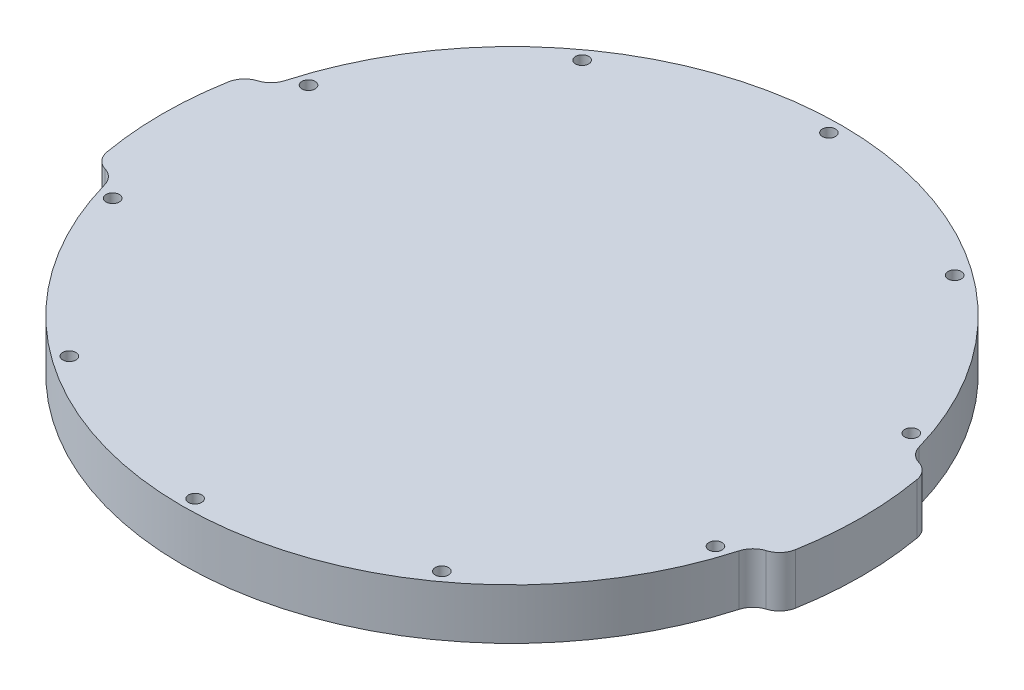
ISO-10303-21;
HEADER;
FILE_DESCRIPTION(('STEP AP214'),'2;1');
FILE_NAME('part.step','',(''),(''),'','','');
FILE_SCHEMA(('AUTOMOTIVE_DESIGN { 1 0 10303 214 1 1 1 1 }'));
ENDSEC;
DATA;
#1=APPLICATION_CONTEXT('core data for automotive mechanical design processes');
#2=APPLICATION_PROTOCOL_DEFINITION('international standard','automotive_design',2000,#1);
#3=PRODUCT_CONTEXT('',#1,'mechanical');
#4=PRODUCT('Part','Part','',(#3));
#5=PRODUCT_RELATED_PRODUCT_CATEGORY('part','',(#4));
#6=PRODUCT_DEFINITION_FORMATION('','',#4);
#7=PRODUCT_DEFINITION_CONTEXT('part definition',#1,'design');
#8=PRODUCT_DEFINITION('design','',#6,#7);
#9=PRODUCT_DEFINITION_SHAPE('','',#8);
#10=(LENGTH_UNIT() NAMED_UNIT(*) SI_UNIT(.MILLI.,.METRE.));
#11=(NAMED_UNIT(*) PLANE_ANGLE_UNIT() SI_UNIT($,.RADIAN.));
#12=(NAMED_UNIT(*) SI_UNIT($,.STERADIAN.) SOLID_ANGLE_UNIT());
#13=UNCERTAINTY_MEASURE_WITH_UNIT(LENGTH_MEASURE(1.E-05),#10,'distance_accuracy_value','');
#14=(GEOMETRIC_REPRESENTATION_CONTEXT(3) GLOBAL_UNCERTAINTY_ASSIGNED_CONTEXT((#13)) GLOBAL_UNIT_ASSIGNED_CONTEXT((#10,
#11,#12)) REPRESENTATION_CONTEXT('',''));
#15=CARTESIAN_POINT('',(0.,0.,0.));
#16=DIRECTION('',(0.,0.,1.));
#17=DIRECTION('',(1.,0.,0.));
#18=AXIS2_PLACEMENT_3D('',#15,#16,#17);
#19=CARTESIAN_POINT('',(-40.6479400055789,12.7,-7.16732853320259));
#20=DIRECTION('',(0.,-1.,0.));
#21=DIRECTION('',(0.,0.,-1.));
#22=AXIS2_PLACEMENT_3D('',#19,#20,#21);
#23=PLANE('',#22);
#24=CARTESIAN_POINT('',(-75.4663345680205,12.7,-24.5204985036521));
#25=DIRECTION('',(0.,1.,0.));
#26=DIRECTION('',(0.,0.,1.));
#27=AXIS2_PLACEMENT_3D('',#24,#25,#26);
#28=CIRCLE('',#27,1.6500000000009);
#29=CARTESIAN_POINT('',(-75.4663345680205,12.7,-22.8704985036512));
#30=VERTEX_POINT('',#29);
#31=EDGE_CURVE('E344',#30,#30,#28,.T.);
#32=ORIENTED_EDGE('',*,*,#31,.F.);
#33=EDGE_LOOP('',(#32));
#34=FACE_BOUND('',#33,.T.);
#35=CARTESIAN_POINT('',(-46.6407597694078,12.7,64.1954985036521));
#36=DIRECTION('',(0.,1.,0.));
#37=DIRECTION('',(0.,0.,1.));
#38=AXIS2_PLACEMENT_3D('',#35,#36,#37);
#39=CIRCLE('',#38,1.65000000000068);
#40=CARTESIAN_POINT('',(-46.6407597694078,12.7,65.8454985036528));
#41=VERTEX_POINT('',#40);
#42=EDGE_CURVE('E332',#41,#41,#39,.T.);
#43=ORIENTED_EDGE('',*,*,#42,.F.);
#44=EDGE_LOOP('',(#43));
#45=FACE_BOUND('',#44,.T.);
#46=CARTESIAN_POINT('',(46.6407597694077,12.7,64.1954985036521));
#47=DIRECTION('',(0.,1.,0.));
#48=DIRECTION('',(0.,0.,1.));
#49=AXIS2_PLACEMENT_3D('',#46,#47,#48);
#50=CIRCLE('',#49,1.65000000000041);
#51=CARTESIAN_POINT('',(46.6407597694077,12.7,65.8454985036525));
#52=VERTEX_POINT('',#51);
#53=EDGE_CURVE('E320',#52,#52,#50,.T.);
#54=ORIENTED_EDGE('',*,*,#53,.F.);
#55=EDGE_LOOP('',(#54));
#56=FACE_BOUND('',#55,.T.);
#57=CARTESIAN_POINT('',(75.4663345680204,12.7,-24.5204985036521));
#58=DIRECTION('',(0.,1.,0.));
#59=DIRECTION('',(0.,0.,1.));
#60=AXIS2_PLACEMENT_3D('',#57,#58,#59);
#61=CIRCLE('',#60,1.65000000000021);
#62=CARTESIAN_POINT('',(75.4663345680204,12.7,-22.8704985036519));
#63=VERTEX_POINT('',#62);
#64=EDGE_CURVE('E308',#63,#63,#61,.T.);
#65=ORIENTED_EDGE('',*,*,#64,.F.);
#66=EDGE_LOOP('',(#65));
#67=FACE_BOUND('',#66,.T.);
#68=CARTESIAN_POINT('',(0.,12.7,-79.35));
#69=DIRECTION('',(0.,1.,0.));
#70=DIRECTION('',(0.,0.,1.));
#71=AXIS2_PLACEMENT_3D('',#68,#69,#70);
#72=CIRCLE('',#71,1.65);
#73=CARTESIAN_POINT('',(0.,12.7,-77.7));
#74=VERTEX_POINT('',#73);
#75=EDGE_CURVE('E276',#74,#74,#72,.T.);
#76=ORIENTED_EDGE('',*,*,#75,.F.);
#77=EDGE_LOOP('',(#76));
#78=FACE_BOUND('',#77,.T.);
#79=CARTESIAN_POINT('',(0.,12.7,0.));
#80=DIRECTION('',(0.,1.,0.));
#81=DIRECTION('',(0.,0.,-1.));
#82=AXIS2_PLACEMENT_3D('',#79,#80,#81);
#83=CIRCLE('',#82,82.55);
#84=CARTESIAN_POINT('',(79.4156922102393,12.7,-22.5310969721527));
#85=VERTEX_POINT('',#84);
#86=CARTESIAN_POINT('',(-79.4156922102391,12.7,-22.531096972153));
#87=VERTEX_POINT('',#86);
#88=EDGE_CURVE('E271',#85,#87,#83,.T.);
#89=ORIENTED_EDGE('',*,*,#88,.T.);
#90=CARTESIAN_POINT('',(-84.2258492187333,12.7,-23.8957909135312));
#91=DIRECTION('',(0.,-1.,0.));
#92=DIRECTION('',(0.,0.,-1.));
#93=AXIS2_PLACEMENT_3D('',#90,#91,#92);
#94=CIRCLE('',#93,5.);
#95=CARTESIAN_POINT('',(-82.7608646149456,12.7,-19.1152239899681));
#96=VERTEX_POINT('',#95);
#97=EDGE_CURVE('E127',#87,#96,#94,.T.);
#98=ORIENTED_EDGE('',*,*,#97,.T.);
#99=CARTESIAN_POINT('',(-81.2958800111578,12.7,-14.3346570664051));
#100=DIRECTION('',(0.,1.,0.));
#101=DIRECTION('',(0.,0.,-1.));
#102=AXIS2_PLACEMENT_3D('',#99,#100,#101);
#103=CIRCLE('',#102,5.00000000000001);
#104=CARTESIAN_POINT('',(-86.2199187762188,12.7,-15.2028979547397));
#105=VERTEX_POINT('',#104);
#106=EDGE_CURVE('E120',#96,#105,#103,.T.);
#107=ORIENTED_EDGE('',*,*,#106,.T.);
#108=CARTESIAN_POINT('',(0.,12.7,0.));
#109=DIRECTION('',(0.,1.,0.));
#110=DIRECTION('',(0.,0.,-1.));
#111=AXIS2_PLACEMENT_3D('',#108,#109,#110);
#112=CIRCLE('',#111,87.55);
#113=CARTESIAN_POINT('',(-86.2199187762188,12.7,15.2028979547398));
#114=VERTEX_POINT('',#113);
#115=EDGE_CURVE('E124',#105,#114,#112,.T.);
#116=ORIENTED_EDGE('',*,*,#115,.T.);
#117=CARTESIAN_POINT('',(-81.2958800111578,12.7,14.3346570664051));
#118=DIRECTION('',(0.,1.,0.));
#119=DIRECTION('',(0.,0.,1.));
#120=AXIS2_PLACEMENT_3D('',#117,#118,#119);
#121=CIRCLE('',#120,5.00000000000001);
#122=CARTESIAN_POINT('',(-82.7608646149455,12.7,19.1152239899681));
#123=VERTEX_POINT('',#122);
#124=EDGE_CURVE('E140',#114,#123,#121,.T.);
#125=ORIENTED_EDGE('',*,*,#124,.T.);
#126=CARTESIAN_POINT('',(-84.2258492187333,12.7,23.8957909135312));
#127=DIRECTION('',(0.,-1.,0.));
#128=DIRECTION('',(0.,0.,-1.));
#129=AXIS2_PLACEMENT_3D('',#126,#127,#128);
#130=CIRCLE('',#129,5.);
#131=CARTESIAN_POINT('',(-79.4156922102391,12.7,22.531096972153));
#132=VERTEX_POINT('',#131);
#133=EDGE_CURVE('E11',#123,#132,#130,.T.);
#134=ORIENTED_EDGE('',*,*,#133,.T.);
#135=CARTESIAN_POINT('',(0.,12.7,-4.92661467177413E-13));
#136=DIRECTION('',(0.,1.,0.));
#137=DIRECTION('',(0.,0.,-1.));
#138=AXIS2_PLACEMENT_3D('',#135,#136,#137);
#139=CIRCLE('',#138,82.5500000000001);
#140=CARTESIAN_POINT('',(79.4156922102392,12.7,22.5310969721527));
#141=VERTEX_POINT('',#140);
#142=EDGE_CURVE('E258',#132,#141,#139,.T.);
#143=ORIENTED_EDGE('',*,*,#142,.T.);
#144=CARTESIAN_POINT('',(84.2258492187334,12.7,23.8957909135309));
#145=DIRECTION('',(0.,-1.,0.));
#146=DIRECTION('',(0.,0.,-1.));
#147=AXIS2_PLACEMENT_3D('',#144,#145,#146);
#148=CIRCLE('',#147,5.);
#149=CARTESIAN_POINT('',(82.7608646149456,12.7,19.1152239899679));
#150=VERTEX_POINT('',#149);
#151=EDGE_CURVE('E171',#141,#150,#148,.T.);
#152=ORIENTED_EDGE('',*,*,#151,.T.);
#153=CARTESIAN_POINT('',(81.2958800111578,12.7,14.3346570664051));
#154=DIRECTION('',(0.,1.,0.));
#155=DIRECTION('',(0.,0.,-1.));
#156=AXIS2_PLACEMENT_3D('',#153,#154,#155);
#157=CIRCLE('',#156,4.99999999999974);
#158=CARTESIAN_POINT('',(86.2199187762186,12.7,15.2028979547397));
#159=VERTEX_POINT('',#158);
#160=EDGE_CURVE('E255',#150,#159,#157,.T.);
#161=ORIENTED_EDGE('',*,*,#160,.T.);
#162=CARTESIAN_POINT('',(-1.29063426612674E-12,12.7,0.));
#163=DIRECTION('',(0.,1.,0.));
#164=DIRECTION('',(0.,0.,1.));
#165=AXIS2_PLACEMENT_3D('',#162,#163,#164);
#166=CIRCLE('',#165,87.550000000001);
#167=CARTESIAN_POINT('',(86.2199187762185,12.7,-15.2028979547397));
#168=VERTEX_POINT('',#167);
#169=EDGE_CURVE('E262',#159,#168,#166,.T.);
#170=ORIENTED_EDGE('',*,*,#169,.T.);
#171=CARTESIAN_POINT('',(81.2958800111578,12.7,-14.3346570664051));
#172=DIRECTION('',(0.,1.,0.));
#173=DIRECTION('',(0.,0.,1.));
#174=AXIS2_PLACEMENT_3D('',#171,#172,#173);
#175=CIRCLE('',#174,4.99999999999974);
#176=CARTESIAN_POINT('',(82.7608646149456,12.7,-19.1152239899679));
#177=VERTEX_POINT('',#176);
#178=EDGE_CURVE('E264',#168,#177,#175,.T.);
#179=ORIENTED_EDGE('',*,*,#178,.T.);
#180=CARTESIAN_POINT('',(84.2258492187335,12.7,-23.8957909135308));
#181=DIRECTION('',(0.,-1.,0.));
#182=DIRECTION('',(0.,0.,-1.));
#183=AXIS2_PLACEMENT_3D('',#180,#181,#182);
#184=CIRCLE('',#183,5.);
#185=EDGE_CURVE('E175',#177,#85,#184,.T.);
#186=ORIENTED_EDGE('',*,*,#185,.T.);
#187=EDGE_LOOP('',(#89,#98,#107,#116,#125,#134,#143,#152,#161,#170,#179,#186));
#188=FACE_BOUND('',#187,.T.);
#189=CARTESIAN_POINT('',(46.6407597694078,12.7,-64.1954985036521));
#190=DIRECTION('',(0.,1.,0.));
#191=DIRECTION('',(0.,0.,1.));
#192=AXIS2_PLACEMENT_3D('',#189,#190,#191);
#193=CIRCLE('',#192,1.65000000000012);
#194=CARTESIAN_POINT('',(46.6407597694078,12.7,-62.5454985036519));
#195=VERTEX_POINT('',#194);
#196=EDGE_CURVE('E302',#195,#195,#193,.T.);
#197=ORIENTED_EDGE('',*,*,#196,.F.);
#198=EDGE_LOOP('',(#197));
#199=FACE_BOUND('',#198,.T.);
#200=CARTESIAN_POINT('',(75.4663345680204,12.7,24.5204985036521));
#201=DIRECTION('',(0.,1.,0.));
#202=DIRECTION('',(0.,0.,1.));
#203=AXIS2_PLACEMENT_3D('',#200,#201,#202);
#204=CIRCLE('',#203,1.65000000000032);
#205=CARTESIAN_POINT('',(75.4663345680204,12.7,26.1704985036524));
#206=VERTEX_POINT('',#205);
#207=EDGE_CURVE('E314',#206,#206,#204,.T.);
#208=ORIENTED_EDGE('',*,*,#207,.F.);
#209=EDGE_LOOP('',(#208));
#210=FACE_BOUND('',#209,.T.);
#211=CARTESIAN_POINT('',(0.,12.7,79.35));
#212=DIRECTION('',(0.,1.,0.));
#213=DIRECTION('',(0.,0.,1.));
#214=AXIS2_PLACEMENT_3D('',#211,#212,#213);
#215=CIRCLE('',#214,1.65000000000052);
#216=CARTESIAN_POINT('',(0.,12.7,81.0000000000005));
#217=VERTEX_POINT('',#216);
#218=EDGE_CURVE('E326',#217,#217,#215,.T.);
#219=ORIENTED_EDGE('',*,*,#218,.F.);
#220=EDGE_LOOP('',(#219));
#221=FACE_BOUND('',#220,.T.);
#222=CARTESIAN_POINT('',(-75.4663345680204,12.7,24.5204985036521));
#223=DIRECTION('',(0.,1.,0.));
#224=DIRECTION('',(0.,0.,1.));
#225=AXIS2_PLACEMENT_3D('',#222,#223,#224);
#226=CIRCLE('',#225,1.65000000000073);
#227=CARTESIAN_POINT('',(-75.4663345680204,12.7,26.1704985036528));
#228=VERTEX_POINT('',#227);
#229=EDGE_CURVE('E338',#228,#228,#226,.T.);
#230=ORIENTED_EDGE('',*,*,#229,.F.);
#231=EDGE_LOOP('',(#230));
#232=FACE_BOUND('',#231,.T.);
#233=CARTESIAN_POINT('',(-46.6407597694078,12.7,-64.1954985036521));
#234=DIRECTION('',(0.,1.,0.));
#235=DIRECTION('',(0.,0.,1.));
#236=AXIS2_PLACEMENT_3D('',#233,#234,#235);
#237=CIRCLE('',#236,1.65000000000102);
#238=CARTESIAN_POINT('',(-46.6407597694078,12.7,-62.545498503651));
#239=VERTEX_POINT('',#238);
#240=EDGE_CURVE('E350',#239,#239,#237,.T.);
#241=ORIENTED_EDGE('',*,*,#240,.F.);
#242=EDGE_LOOP('',(#241));
#243=FACE_BOUND('',#242,.T.);
#244=ADVANCED_FACE('F32',(#34,#45,#56,#67,#78,#188,#199,#210,#221,#232,#243),#23,.F.);
#245=CARTESIAN_POINT('',(-40.6479400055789,0.,-7.16732853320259));
#246=DIRECTION('',(0.,-1.,0.));
#247=DIRECTION('',(0.,0.,-1.));
#248=AXIS2_PLACEMENT_3D('',#245,#246,#247);
#249=PLANE('',#248);
#250=CARTESIAN_POINT('',(-75.4663345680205,0.,-24.5204985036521));
#251=DIRECTION('',(0.,1.,0.));
#252=DIRECTION('',(0.,0.,1.));
#253=AXIS2_PLACEMENT_3D('',#250,#251,#252);
#254=CIRCLE('',#253,1.6500000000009);
#255=CARTESIAN_POINT('',(-75.4663345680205,0.,-22.8704985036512));
#256=VERTEX_POINT('',#255);
#257=EDGE_CURVE('E347',#256,#256,#254,.T.);
#258=ORIENTED_EDGE('',*,*,#257,.T.);
#259=EDGE_LOOP('',(#258));
#260=FACE_BOUND('',#259,.T.);
#261=CARTESIAN_POINT('',(-46.6407597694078,0.,64.1954985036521));
#262=DIRECTION('',(0.,1.,0.));
#263=DIRECTION('',(0.,0.,1.));
#264=AXIS2_PLACEMENT_3D('',#261,#262,#263);
#265=CIRCLE('',#264,1.65000000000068);
#266=CARTESIAN_POINT('',(-46.6407597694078,0.,65.8454985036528));
#267=VERTEX_POINT('',#266);
#268=EDGE_CURVE('E335',#267,#267,#265,.T.);
#269=ORIENTED_EDGE('',*,*,#268,.T.);
#270=EDGE_LOOP('',(#269));
#271=FACE_BOUND('',#270,.T.);
#272=CARTESIAN_POINT('',(46.6407597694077,0.,64.1954985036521));
#273=DIRECTION('',(0.,1.,0.));
#274=DIRECTION('',(0.,0.,1.));
#275=AXIS2_PLACEMENT_3D('',#272,#273,#274);
#276=CIRCLE('',#275,1.65000000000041);
#277=CARTESIAN_POINT('',(46.6407597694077,0.,65.8454985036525));
#278=VERTEX_POINT('',#277);
#279=EDGE_CURVE('E323',#278,#278,#276,.T.);
#280=ORIENTED_EDGE('',*,*,#279,.T.);
#281=EDGE_LOOP('',(#280));
#282=FACE_BOUND('',#281,.T.);
#283=CARTESIAN_POINT('',(75.4663345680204,0.,-24.5204985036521));
#284=DIRECTION('',(0.,1.,0.));
#285=DIRECTION('',(0.,0.,1.));
#286=AXIS2_PLACEMENT_3D('',#283,#284,#285);
#287=CIRCLE('',#286,1.65000000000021);
#288=CARTESIAN_POINT('',(75.4663345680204,0.,-22.8704985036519));
#289=VERTEX_POINT('',#288);
#290=EDGE_CURVE('E311',#289,#289,#287,.T.);
#291=ORIENTED_EDGE('',*,*,#290,.T.);
#292=EDGE_LOOP('',(#291));
#293=FACE_BOUND('',#292,.T.);
#294=CARTESIAN_POINT('',(0.,0.,-79.35));
#295=DIRECTION('',(0.,1.,0.));
#296=DIRECTION('',(0.,0.,1.));
#297=AXIS2_PLACEMENT_3D('',#294,#295,#296);
#298=CIRCLE('',#297,1.65);
#299=CARTESIAN_POINT('',(0.,0.,-77.7));
#300=VERTEX_POINT('',#299);
#301=EDGE_CURVE('E299',#300,#300,#298,.T.);
#302=ORIENTED_EDGE('',*,*,#301,.T.);
#303=EDGE_LOOP('',(#302));
#304=FACE_BOUND('',#303,.T.);
#305=CARTESIAN_POINT('',(-81.2958800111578,0.,-14.3346570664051));
#306=DIRECTION('',(0.,1.,0.));
#307=DIRECTION('',(0.,0.,-1.));
#308=AXIS2_PLACEMENT_3D('',#305,#306,#307);
#309=CIRCLE('',#308,5.00000000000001);
#310=CARTESIAN_POINT('',(-82.7608646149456,0.,-19.1152239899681));
#311=VERTEX_POINT('',#310);
#312=CARTESIAN_POINT('',(-86.2199187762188,0.,-15.2028979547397));
#313=VERTEX_POINT('',#312);
#314=EDGE_CURVE('E144',#311,#313,#309,.T.);
#315=ORIENTED_EDGE('',*,*,#314,.F.);
#316=CARTESIAN_POINT('',(-84.2258492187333,0.,-23.8957909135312));
#317=DIRECTION('',(0.,-1.,0.));
#318=DIRECTION('',(0.,0.,-1.));
#319=AXIS2_PLACEMENT_3D('',#316,#317,#318);
#320=CIRCLE('',#319,5.);
#321=CARTESIAN_POINT('',(-79.4156922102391,0.,-22.531096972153));
#322=VERTEX_POINT('',#321);
#323=EDGE_CURVE('E177',#311,#322,#320,.F.);
#324=ORIENTED_EDGE('',*,*,#323,.T.);
#325=CARTESIAN_POINT('',(0.,0.,0.));
#326=DIRECTION('',(0.,1.,0.));
#327=DIRECTION('',(0.,0.,-1.));
#328=AXIS2_PLACEMENT_3D('',#325,#326,#327);
#329=CIRCLE('',#328,82.55);
#330=CARTESIAN_POINT('',(79.4156922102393,0.,-22.5310969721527));
#331=VERTEX_POINT('',#330);
#332=EDGE_CURVE('E132',#331,#322,#329,.T.);
#333=ORIENTED_EDGE('',*,*,#332,.F.);
#334=CARTESIAN_POINT('',(84.2258492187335,0.,-23.8957909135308));
#335=DIRECTION('',(0.,-1.,0.));
#336=DIRECTION('',(0.,0.,-1.));
#337=AXIS2_PLACEMENT_3D('',#334,#335,#336);
#338=CIRCLE('',#337,5.);
#339=CARTESIAN_POINT('',(82.7608646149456,0.,-19.1152239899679));
#340=VERTEX_POINT('',#339);
#341=EDGE_CURVE('E173',#331,#340,#338,.F.);
#342=ORIENTED_EDGE('',*,*,#341,.T.);
#343=CARTESIAN_POINT('',(81.2958800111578,0.,-14.3346570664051));
#344=DIRECTION('',(0.,1.,0.));
#345=DIRECTION('',(0.,0.,1.));
#346=AXIS2_PLACEMENT_3D('',#343,#344,#345);
#347=CIRCLE('',#346,4.99999999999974);
#348=CARTESIAN_POINT('',(86.2199187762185,0.,-15.2028979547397));
#349=VERTEX_POINT('',#348);
#350=EDGE_CURVE('E189',#349,#340,#347,.T.);
#351=ORIENTED_EDGE('',*,*,#350,.F.);
#352=CARTESIAN_POINT('',(-1.29063426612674E-12,0.,0.));
#353=DIRECTION('',(0.,1.,0.));
#354=DIRECTION('',(0.,0.,1.));
#355=AXIS2_PLACEMENT_3D('',#352,#353,#354);
#356=CIRCLE('',#355,87.550000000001);
#357=CARTESIAN_POINT('',(86.2199187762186,0.,15.2028979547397));
#358=VERTEX_POINT('',#357);
#359=EDGE_CURVE('E285',#358,#349,#356,.T.);
#360=ORIENTED_EDGE('',*,*,#359,.F.);
#361=CARTESIAN_POINT('',(81.2958800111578,0.,14.3346570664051));
#362=DIRECTION('',(0.,1.,0.));
#363=DIRECTION('',(0.,0.,-1.));
#364=AXIS2_PLACEMENT_3D('',#361,#362,#363);
#365=CIRCLE('',#364,4.99999999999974);
#366=CARTESIAN_POINT('',(82.7608646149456,0.,19.1152239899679));
#367=VERTEX_POINT('',#366);
#368=EDGE_CURVE('E283',#367,#358,#365,.T.);
#369=ORIENTED_EDGE('',*,*,#368,.F.);
#370=CARTESIAN_POINT('',(84.2258492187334,0.,23.8957909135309));
#371=DIRECTION('',(0.,-1.,0.));
#372=DIRECTION('',(0.,0.,-1.));
#373=AXIS2_PLACEMENT_3D('',#370,#371,#372);
#374=CIRCLE('',#373,5.);
#375=CARTESIAN_POINT('',(79.4156922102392,0.,22.5310969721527));
#376=VERTEX_POINT('',#375);
#377=EDGE_CURVE('E169',#367,#376,#374,.F.);
#378=ORIENTED_EDGE('',*,*,#377,.T.);
#379=CARTESIAN_POINT('',(0.,0.,-4.92661467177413E-13));
#380=DIRECTION('',(0.,1.,0.));
#381=DIRECTION('',(0.,0.,-1.));
#382=AXIS2_PLACEMENT_3D('',#379,#380,#381);
#383=CIRCLE('',#382,82.5500000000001);
#384=CARTESIAN_POINT('',(-79.4156922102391,0.,22.531096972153));
#385=VERTEX_POINT('',#384);
#386=EDGE_CURVE('E280',#385,#376,#383,.T.);
#387=ORIENTED_EDGE('',*,*,#386,.F.);
#388=CARTESIAN_POINT('',(-84.2258492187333,0.,23.8957909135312));
#389=DIRECTION('',(0.,-1.,0.));
#390=DIRECTION('',(0.,0.,-1.));
#391=AXIS2_PLACEMENT_3D('',#388,#389,#390);
#392=CIRCLE('',#391,5.);
#393=CARTESIAN_POINT('',(-82.7608646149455,0.,19.1152239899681));
#394=VERTEX_POINT('',#393);
#395=EDGE_CURVE('E40',#385,#394,#392,.F.);
#396=ORIENTED_EDGE('',*,*,#395,.T.);
#397=CARTESIAN_POINT('',(-81.2958800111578,0.,14.3346570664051));
#398=DIRECTION('',(0.,1.,0.));
#399=DIRECTION('',(0.,0.,1.));
#400=AXIS2_PLACEMENT_3D('',#397,#398,#399);
#401=CIRCLE('',#400,5.00000000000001);
#402=CARTESIAN_POINT('',(-86.2199187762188,0.,15.2028979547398));
#403=VERTEX_POINT('',#402);
#404=EDGE_CURVE('E278',#403,#394,#401,.T.);
#405=ORIENTED_EDGE('',*,*,#404,.F.);
#406=CARTESIAN_POINT('',(0.,0.,0.));
#407=DIRECTION('',(0.,1.,0.));
#408=DIRECTION('',(0.,0.,-1.));
#409=AXIS2_PLACEMENT_3D('',#406,#407,#408);
#410=CIRCLE('',#409,87.55);
#411=EDGE_CURVE('E275',#313,#403,#410,.T.);
#412=ORIENTED_EDGE('',*,*,#411,.F.);
#413=EDGE_LOOP('',(#315,#324,#333,#342,#351,#360,#369,#378,#387,#396,#405,#412));
#414=FACE_BOUND('',#413,.T.);
#415=CARTESIAN_POINT('',(46.6407597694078,0.,-64.1954985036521));
#416=DIRECTION('',(0.,1.,0.));
#417=DIRECTION('',(0.,0.,1.));
#418=AXIS2_PLACEMENT_3D('',#415,#416,#417);
#419=CIRCLE('',#418,1.65000000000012);
#420=CARTESIAN_POINT('',(46.6407597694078,0.,-62.5454985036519));
#421=VERTEX_POINT('',#420);
#422=EDGE_CURVE('E305',#421,#421,#419,.T.);
#423=ORIENTED_EDGE('',*,*,#422,.T.);
#424=EDGE_LOOP('',(#423));
#425=FACE_BOUND('',#424,.T.);
#426=CARTESIAN_POINT('',(75.4663345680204,0.,24.5204985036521));
#427=DIRECTION('',(0.,1.,0.));
#428=DIRECTION('',(0.,0.,1.));
#429=AXIS2_PLACEMENT_3D('',#426,#427,#428);
#430=CIRCLE('',#429,1.65000000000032);
#431=CARTESIAN_POINT('',(75.4663345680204,0.,26.1704985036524));
#432=VERTEX_POINT('',#431);
#433=EDGE_CURVE('E317',#432,#432,#430,.T.);
#434=ORIENTED_EDGE('',*,*,#433,.T.);
#435=EDGE_LOOP('',(#434));
#436=FACE_BOUND('',#435,.T.);
#437=CARTESIAN_POINT('',(0.,0.,79.35));
#438=DIRECTION('',(0.,1.,0.));
#439=DIRECTION('',(0.,0.,1.));
#440=AXIS2_PLACEMENT_3D('',#437,#438,#439);
#441=CIRCLE('',#440,1.65000000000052);
#442=CARTESIAN_POINT('',(0.,0.,81.0000000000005));
#443=VERTEX_POINT('',#442);
#444=EDGE_CURVE('E329',#443,#443,#441,.T.);
#445=ORIENTED_EDGE('',*,*,#444,.T.);
#446=EDGE_LOOP('',(#445));
#447=FACE_BOUND('',#446,.T.);
#448=CARTESIAN_POINT('',(-75.4663345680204,0.,24.5204985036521));
#449=DIRECTION('',(0.,1.,0.));
#450=DIRECTION('',(0.,0.,1.));
#451=AXIS2_PLACEMENT_3D('',#448,#449,#450);
#452=CIRCLE('',#451,1.65000000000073);
#453=CARTESIAN_POINT('',(-75.4663345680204,0.,26.1704985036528));
#454=VERTEX_POINT('',#453);
#455=EDGE_CURVE('E341',#454,#454,#452,.T.);
#456=ORIENTED_EDGE('',*,*,#455,.T.);
#457=EDGE_LOOP('',(#456));
#458=FACE_BOUND('',#457,.T.);
#459=CARTESIAN_POINT('',(-46.6407597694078,0.,-64.1954985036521));
#460=DIRECTION('',(0.,1.,0.));
#461=DIRECTION('',(0.,0.,1.));
#462=AXIS2_PLACEMENT_3D('',#459,#460,#461);
#463=CIRCLE('',#462,1.65000000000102);
#464=CARTESIAN_POINT('',(-46.6407597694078,0.,-62.545498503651));
#465=VERTEX_POINT('',#464);
#466=EDGE_CURVE('E353',#465,#465,#463,.T.);
#467=ORIENTED_EDGE('',*,*,#466,.T.);
#468=EDGE_LOOP('',(#467));
#469=FACE_BOUND('',#468,.T.);
#470=ADVANCED_FACE('F181',(#260,#271,#282,#293,#304,#414,#425,#436,#447,#458,#469),#249,.T.);
#471=CARTESIAN_POINT('',(-81.2958800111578,12.7,-14.3346570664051));
#472=DIRECTION('',(0.,-1.,0.));
#473=DIRECTION('',(0.,0.,-1.));
#474=AXIS2_PLACEMENT_3D('',#471,#472,#473);
#475=CYLINDRICAL_SURFACE('',#474,5.00000000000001);
#476=ORIENTED_EDGE('',*,*,#106,.F.);
#477=DIRECTION('',(0.,-1.,0.));
#478=VECTOR('',#477,1.);
#479=CARTESIAN_POINT('',(-82.7608646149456,12.7,-19.1152239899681));
#480=LINE('',#479,#478);
#481=EDGE_CURVE('E166',#96,#311,#480,.T.);
#482=ORIENTED_EDGE('',*,*,#481,.T.);
#483=ORIENTED_EDGE('',*,*,#314,.T.);
#484=DIRECTION('',(0.,-1.,0.));
#485=VECTOR('',#484,1.);
#486=CARTESIAN_POINT('',(-86.2199187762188,12.7,-15.2028979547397));
#487=LINE('',#486,#485);
#488=EDGE_CURVE('E137',#105,#313,#487,.T.);
#489=ORIENTED_EDGE('',*,*,#488,.F.);
#490=EDGE_LOOP('',(#476,#482,#483,#489));
#491=FACE_BOUND('',#490,.T.);
#492=ADVANCED_FACE('F142',(#491),#475,.T.);
#493=CARTESIAN_POINT('',(0.,12.7,0.));
#494=DIRECTION('',(0.,-1.,0.));
#495=DIRECTION('',(0.,0.,-1.));
#496=AXIS2_PLACEMENT_3D('',#493,#494,#495);
#497=CYLINDRICAL_SURFACE('',#496,87.55);
#498=ORIENTED_EDGE('',*,*,#411,.T.);
#499=DIRECTION('',(0.,-1.,0.));
#500=VECTOR('',#499,1.);
#501=CARTESIAN_POINT('',(-86.2199187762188,12.7,15.2028979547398));
#502=LINE('',#501,#500);
#503=EDGE_CURVE('E139',#114,#403,#502,.T.);
#504=ORIENTED_EDGE('',*,*,#503,.F.);
#505=ORIENTED_EDGE('',*,*,#115,.F.);
#506=ORIENTED_EDGE('',*,*,#488,.T.);
#507=EDGE_LOOP('',(#498,#504,#505,#506));
#508=FACE_BOUND('',#507,.T.);
#509=ADVANCED_FACE('F136',(#508),#497,.T.);
#510=CARTESIAN_POINT('',(-81.2958800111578,12.7,14.3346570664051));
#511=DIRECTION('',(0.,-1.,0.));
#512=DIRECTION('',(0.,0.,-1.));
#513=AXIS2_PLACEMENT_3D('',#510,#511,#512);
#514=CYLINDRICAL_SURFACE('',#513,5.00000000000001);
#515=ORIENTED_EDGE('',*,*,#404,.T.);
#516=DIRECTION('',(0.,-1.,0.));
#517=VECTOR('',#516,1.);
#518=CARTESIAN_POINT('',(-82.7608646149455,12.7,19.1152239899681));
#519=LINE('',#518,#517);
#520=EDGE_CURVE('E47',#394,#123,#519,.F.);
#521=ORIENTED_EDGE('',*,*,#520,.T.);
#522=ORIENTED_EDGE('',*,*,#124,.F.);
#523=ORIENTED_EDGE('',*,*,#503,.T.);
#524=EDGE_LOOP('',(#515,#521,#522,#523));
#525=FACE_BOUND('',#524,.T.);
#526=ADVANCED_FACE('F233',(#525),#514,.T.);
#527=CARTESIAN_POINT('',(0.,12.7,-4.92661467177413E-13));
#528=DIRECTION('',(0.,-1.,0.));
#529=DIRECTION('',(0.,0.,-1.));
#530=AXIS2_PLACEMENT_3D('',#527,#528,#529);
#531=CYLINDRICAL_SURFACE('',#530,82.5500000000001);
#532=ORIENTED_EDGE('',*,*,#386,.T.);
#533=DIRECTION('',(0.,-1.,0.));
#534=VECTOR('',#533,1.);
#535=CARTESIAN_POINT('',(79.4156922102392,12.7,22.5310969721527));
#536=LINE('',#535,#534);
#537=EDGE_CURVE('E157',#376,#141,#536,.F.);
#538=ORIENTED_EDGE('',*,*,#537,.T.);
#539=ORIENTED_EDGE('',*,*,#142,.F.);
#540=DIRECTION('',(0.,-1.,0.));
#541=VECTOR('',#540,1.);
#542=CARTESIAN_POINT('',(-79.4156922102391,12.7,22.531096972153));
#543=LINE('',#542,#541);
#544=EDGE_CURVE('E149',#132,#385,#543,.T.);
#545=ORIENTED_EDGE('',*,*,#544,.T.);
#546=EDGE_LOOP('',(#532,#538,#539,#545));
#547=FACE_BOUND('',#546,.T.);
#548=ADVANCED_FACE('F229',(#547),#531,.T.);
#549=CARTESIAN_POINT('',(81.2958800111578,12.7,14.3346570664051));
#550=DIRECTION('',(0.,-1.,0.));
#551=DIRECTION('',(0.,0.,-1.));
#552=AXIS2_PLACEMENT_3D('',#549,#550,#551);
#553=CYLINDRICAL_SURFACE('',#552,4.99999999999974);
#554=ORIENTED_EDGE('',*,*,#160,.F.);
#555=DIRECTION('',(0.,-1.,0.));
#556=VECTOR('',#555,1.);
#557=CARTESIAN_POINT('',(82.7608646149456,12.7,19.1152239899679));
#558=LINE('',#557,#556);
#559=EDGE_CURVE('E146',#150,#367,#558,.T.);
#560=ORIENTED_EDGE('',*,*,#559,.T.);
#561=ORIENTED_EDGE('',*,*,#368,.T.);
#562=DIRECTION('',(0.,-1.,0.));
#563=VECTOR('',#562,1.);
#564=CARTESIAN_POINT('',(86.2199187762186,12.7,15.2028979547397));
#565=LINE('',#564,#563);
#566=EDGE_CURVE('E151',#159,#358,#565,.T.);
#567=ORIENTED_EDGE('',*,*,#566,.F.);
#568=EDGE_LOOP('',(#554,#560,#561,#567));
#569=FACE_BOUND('',#568,.T.);
#570=ADVANCED_FACE('F225',(#569),#553,.T.);
#571=CARTESIAN_POINT('',(-1.29063426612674E-12,12.7,0.));
#572=DIRECTION('',(0.,-1.,0.));
#573=DIRECTION('',(0.,0.,-1.));
#574=AXIS2_PLACEMENT_3D('',#571,#572,#573);
#575=CYLINDRICAL_SURFACE('',#574,87.550000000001);
#576=ORIENTED_EDGE('',*,*,#359,.T.);
#577=DIRECTION('',(0.,-1.,0.));
#578=VECTOR('',#577,1.);
#579=CARTESIAN_POINT('',(86.2199187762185,12.7,-15.2028979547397));
#580=LINE('',#579,#578);
#581=EDGE_CURVE('E273',#168,#349,#580,.T.);
#582=ORIENTED_EDGE('',*,*,#581,.F.);
#583=ORIENTED_EDGE('',*,*,#169,.F.);
#584=ORIENTED_EDGE('',*,*,#566,.T.);
#585=EDGE_LOOP('',(#576,#582,#583,#584));
#586=FACE_BOUND('',#585,.T.);
#587=ADVANCED_FACE('F221',(#586),#575,.T.);
#588=CARTESIAN_POINT('',(81.2958800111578,12.7,-14.3346570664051));
#589=DIRECTION('',(0.,-1.,0.));
#590=DIRECTION('',(0.,0.,-1.));
#591=AXIS2_PLACEMENT_3D('',#588,#589,#590);
#592=CYLINDRICAL_SURFACE('',#591,4.99999999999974);
#593=ORIENTED_EDGE('',*,*,#350,.T.);
#594=DIRECTION('',(0.,-1.,0.));
#595=VECTOR('',#594,1.);
#596=CARTESIAN_POINT('',(82.7608646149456,12.7,-19.1152239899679));
#597=LINE('',#596,#595);
#598=EDGE_CURVE('E164',#340,#177,#597,.F.);
#599=ORIENTED_EDGE('',*,*,#598,.T.);
#600=ORIENTED_EDGE('',*,*,#178,.F.);
#601=ORIENTED_EDGE('',*,*,#581,.T.);
#602=EDGE_LOOP('',(#593,#599,#600,#601));
#603=FACE_BOUND('',#602,.T.);
#604=ADVANCED_FACE('F218',(#603),#592,.T.);
#605=CARTESIAN_POINT('',(0.,12.7,0.));
#606=DIRECTION('',(0.,-1.,0.));
#607=DIRECTION('',(0.,0.,-1.));
#608=AXIS2_PLACEMENT_3D('',#605,#606,#607);
#609=CYLINDRICAL_SURFACE('',#608,82.55);
#610=ORIENTED_EDGE('',*,*,#88,.F.);
#611=DIRECTION('',(0.,-1.,0.));
#612=VECTOR('',#611,1.);
#613=CARTESIAN_POINT('',(79.4156922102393,12.7,-22.5310969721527));
#614=LINE('',#613,#612);
#615=EDGE_CURVE('E161',#85,#331,#614,.T.);
#616=ORIENTED_EDGE('',*,*,#615,.T.);
#617=ORIENTED_EDGE('',*,*,#332,.T.);
#618=DIRECTION('',(0.,-1.,0.));
#619=VECTOR('',#618,1.);
#620=CARTESIAN_POINT('',(-79.4156922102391,12.7,-22.531096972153));
#621=LINE('',#620,#619);
#622=EDGE_CURVE('E159',#322,#87,#621,.F.);
#623=ORIENTED_EDGE('',*,*,#622,.T.);
#624=EDGE_LOOP('',(#610,#616,#617,#623));
#625=FACE_BOUND('',#624,.T.);
#626=ADVANCED_FACE('F187',(#625),#609,.T.);
#627=CARTESIAN_POINT('',(0.,12.7,-79.35));
#628=DIRECTION('',(0.,-1.,0.));
#629=DIRECTION('',(0.,0.,-1.));
#630=AXIS2_PLACEMENT_3D('',#627,#628,#629);
#631=CYLINDRICAL_SURFACE('',#630,1.65);
#632=ORIENTED_EDGE('',*,*,#75,.T.);
#633=EDGE_LOOP('',(#632));
#634=FACE_BOUND('',#633,.T.);
#635=ORIENTED_EDGE('',*,*,#301,.F.);
#636=EDGE_LOOP('',(#635));
#637=FACE_BOUND('',#636,.T.);
#638=ADVANCED_FACE('F213',(#634,#637),#631,.F.);
#639=CARTESIAN_POINT('',(46.6407597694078,12.7,-64.1954985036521));
#640=DIRECTION('',(0.,-1.,0.));
#641=DIRECTION('',(0.,0.,-1.));
#642=AXIS2_PLACEMENT_3D('',#639,#640,#641);
#643=CYLINDRICAL_SURFACE('',#642,1.65000000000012);
#644=ORIENTED_EDGE('',*,*,#196,.T.);
#645=EDGE_LOOP('',(#644));
#646=FACE_BOUND('',#645,.T.);
#647=ORIENTED_EDGE('',*,*,#422,.F.);
#648=EDGE_LOOP('',(#647));
#649=FACE_BOUND('',#648,.T.);
#650=ADVANCED_FACE('F378',(#646,#649),#643,.F.);
#651=CARTESIAN_POINT('',(75.4663345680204,12.7,-24.5204985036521));
#652=DIRECTION('',(0.,-1.,0.));
#653=DIRECTION('',(0.,0.,-1.));
#654=AXIS2_PLACEMENT_3D('',#651,#652,#653);
#655=CYLINDRICAL_SURFACE('',#654,1.65000000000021);
#656=ORIENTED_EDGE('',*,*,#64,.T.);
#657=EDGE_LOOP('',(#656));
#658=FACE_BOUND('',#657,.T.);
#659=ORIENTED_EDGE('',*,*,#290,.F.);
#660=EDGE_LOOP('',(#659));
#661=FACE_BOUND('',#660,.T.);
#662=ADVANCED_FACE('F383',(#658,#661),#655,.F.);
#663=CARTESIAN_POINT('',(75.4663345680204,12.7,24.5204985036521));
#664=DIRECTION('',(0.,-1.,0.));
#665=DIRECTION('',(0.,0.,-1.));
#666=AXIS2_PLACEMENT_3D('',#663,#664,#665);
#667=CYLINDRICAL_SURFACE('',#666,1.65000000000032);
#668=ORIENTED_EDGE('',*,*,#207,.T.);
#669=EDGE_LOOP('',(#668));
#670=FACE_BOUND('',#669,.T.);
#671=ORIENTED_EDGE('',*,*,#433,.F.);
#672=EDGE_LOOP('',(#671));
#673=FACE_BOUND('',#672,.T.);
#674=ADVANCED_FACE('F390',(#670,#673),#667,.F.);
#675=CARTESIAN_POINT('',(46.6407597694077,12.7,64.1954985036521));
#676=DIRECTION('',(0.,-1.,0.));
#677=DIRECTION('',(0.,0.,-1.));
#678=AXIS2_PLACEMENT_3D('',#675,#676,#677);
#679=CYLINDRICAL_SURFACE('',#678,1.65000000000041);
#680=ORIENTED_EDGE('',*,*,#53,.T.);
#681=EDGE_LOOP('',(#680));
#682=FACE_BOUND('',#681,.T.);
#683=ORIENTED_EDGE('',*,*,#279,.F.);
#684=EDGE_LOOP('',(#683));
#685=FACE_BOUND('',#684,.T.);
#686=ADVANCED_FACE('F397',(#682,#685),#679,.F.);
#687=CARTESIAN_POINT('',(0.,12.7,79.35));
#688=DIRECTION('',(0.,-1.,0.));
#689=DIRECTION('',(0.,0.,-1.));
#690=AXIS2_PLACEMENT_3D('',#687,#688,#689);
#691=CYLINDRICAL_SURFACE('',#690,1.65000000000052);
#692=ORIENTED_EDGE('',*,*,#218,.T.);
#693=EDGE_LOOP('',(#692));
#694=FACE_BOUND('',#693,.T.);
#695=ORIENTED_EDGE('',*,*,#444,.F.);
#696=EDGE_LOOP('',(#695));
#697=FACE_BOUND('',#696,.T.);
#698=ADVANCED_FACE('F401',(#694,#697),#691,.F.);
#699=CARTESIAN_POINT('',(-46.6407597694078,12.7,64.1954985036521));
#700=DIRECTION('',(0.,-1.,0.));
#701=DIRECTION('',(0.,0.,-1.));
#702=AXIS2_PLACEMENT_3D('',#699,#700,#701);
#703=CYLINDRICAL_SURFACE('',#702,1.65000000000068);
#704=ORIENTED_EDGE('',*,*,#42,.T.);
#705=EDGE_LOOP('',(#704));
#706=FACE_BOUND('',#705,.T.);
#707=ORIENTED_EDGE('',*,*,#268,.F.);
#708=EDGE_LOOP('',(#707));
#709=FACE_BOUND('',#708,.T.);
#710=ADVANCED_FACE('F405',(#706,#709),#703,.F.);
#711=CARTESIAN_POINT('',(-75.4663345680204,12.7,24.5204985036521));
#712=DIRECTION('',(0.,-1.,0.));
#713=DIRECTION('',(0.,0.,-1.));
#714=AXIS2_PLACEMENT_3D('',#711,#712,#713);
#715=CYLINDRICAL_SURFACE('',#714,1.65000000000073);
#716=ORIENTED_EDGE('',*,*,#229,.T.);
#717=EDGE_LOOP('',(#716));
#718=FACE_BOUND('',#717,.T.);
#719=ORIENTED_EDGE('',*,*,#455,.F.);
#720=EDGE_LOOP('',(#719));
#721=FACE_BOUND('',#720,.T.);
#722=ADVANCED_FACE('F365',(#718,#721),#715,.F.);
#723=CARTESIAN_POINT('',(-75.4663345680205,12.7,-24.5204985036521));
#724=DIRECTION('',(0.,-1.,0.));
#725=DIRECTION('',(0.,0.,-1.));
#726=AXIS2_PLACEMENT_3D('',#723,#724,#725);
#727=CYLINDRICAL_SURFACE('',#726,1.6500000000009);
#728=ORIENTED_EDGE('',*,*,#31,.T.);
#729=EDGE_LOOP('',(#728));
#730=FACE_BOUND('',#729,.T.);
#731=ORIENTED_EDGE('',*,*,#257,.F.);
#732=EDGE_LOOP('',(#731));
#733=FACE_BOUND('',#732,.T.);
#734=ADVANCED_FACE('F247',(#730,#733),#727,.F.);
#735=CARTESIAN_POINT('',(-46.6407597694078,12.7,-64.1954985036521));
#736=DIRECTION('',(0.,-1.,0.));
#737=DIRECTION('',(0.,0.,-1.));
#738=AXIS2_PLACEMENT_3D('',#735,#736,#737);
#739=CYLINDRICAL_SURFACE('',#738,1.65000000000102);
#740=ORIENTED_EDGE('',*,*,#240,.T.);
#741=EDGE_LOOP('',(#740));
#742=FACE_BOUND('',#741,.T.);
#743=ORIENTED_EDGE('',*,*,#466,.F.);
#744=EDGE_LOOP('',(#743));
#745=FACE_BOUND('',#744,.T.);
#746=ADVANCED_FACE('F242',(#742,#745),#739,.F.);
#747=CARTESIAN_POINT('',(84.2258492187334,12.7,23.8957909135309));
#748=DIRECTION('',(0.,1.,0.));
#749=DIRECTION('',(0.,0.,1.));
#750=AXIS2_PLACEMENT_3D('',#747,#748,#749);
#751=CYLINDRICAL_SURFACE('',#750,5.);
#752=ORIENTED_EDGE('',*,*,#151,.F.);
#753=ORIENTED_EDGE('',*,*,#537,.F.);
#754=ORIENTED_EDGE('',*,*,#377,.F.);
#755=ORIENTED_EDGE('',*,*,#559,.F.);
#756=EDGE_LOOP('',(#752,#753,#754,#755));
#757=FACE_BOUND('',#756,.T.);
#758=ADVANCED_FACE('F199',(#757),#751,.F.);
#759=CARTESIAN_POINT('',(84.2258492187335,12.7,-23.8957909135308));
#760=DIRECTION('',(0.,1.,0.));
#761=DIRECTION('',(0.,0.,1.));
#762=AXIS2_PLACEMENT_3D('',#759,#760,#761);
#763=CYLINDRICAL_SURFACE('',#762,5.);
#764=ORIENTED_EDGE('',*,*,#185,.F.);
#765=ORIENTED_EDGE('',*,*,#598,.F.);
#766=ORIENTED_EDGE('',*,*,#341,.F.);
#767=ORIENTED_EDGE('',*,*,#615,.F.);
#768=EDGE_LOOP('',(#764,#765,#766,#767));
#769=FACE_BOUND('',#768,.T.);
#770=ADVANCED_FACE('F193',(#769),#763,.F.);
#771=CARTESIAN_POINT('',(-84.2258492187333,12.7,-23.8957909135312));
#772=DIRECTION('',(0.,1.,0.));
#773=DIRECTION('',(0.,0.,1.));
#774=AXIS2_PLACEMENT_3D('',#771,#772,#773);
#775=CYLINDRICAL_SURFACE('',#774,5.);
#776=ORIENTED_EDGE('',*,*,#97,.F.);
#777=ORIENTED_EDGE('',*,*,#622,.F.);
#778=ORIENTED_EDGE('',*,*,#323,.F.);
#779=ORIENTED_EDGE('',*,*,#481,.F.);
#780=EDGE_LOOP('',(#776,#777,#778,#779));
#781=FACE_BOUND('',#780,.T.);
#782=ADVANCED_FACE('F191',(#781),#775,.F.);
#783=CARTESIAN_POINT('',(-84.2258492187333,12.7,23.8957909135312));
#784=DIRECTION('',(0.,1.,0.));
#785=DIRECTION('',(0.,0.,1.));
#786=AXIS2_PLACEMENT_3D('',#783,#784,#785);
#787=CYLINDRICAL_SURFACE('',#786,5.);
#788=ORIENTED_EDGE('',*,*,#133,.F.);
#789=ORIENTED_EDGE('',*,*,#520,.F.);
#790=ORIENTED_EDGE('',*,*,#395,.F.);
#791=ORIENTED_EDGE('',*,*,#544,.F.);
#792=EDGE_LOOP('',(#788,#789,#790,#791));
#793=FACE_BOUND('',#792,.T.);
#794=ADVANCED_FACE('F34',(#793),#787,.F.);
#795=CLOSED_SHELL('',(#244,#470,#492,#509,#526,#548,#570,#587,#604,#626,#638,#650,#662,#674,
#686,#698,#710,#722,#734,#746,#758,#770,#782,#794));
#796=MANIFOLD_SOLID_BREP('B2',#795);
#797=ADVANCED_BREP_SHAPE_REPRESENTATION('',(#18,#796),#14);
#798=SHAPE_DEFINITION_REPRESENTATION(#9,#797);
ENDSEC;
END-ISO-10303-21;
